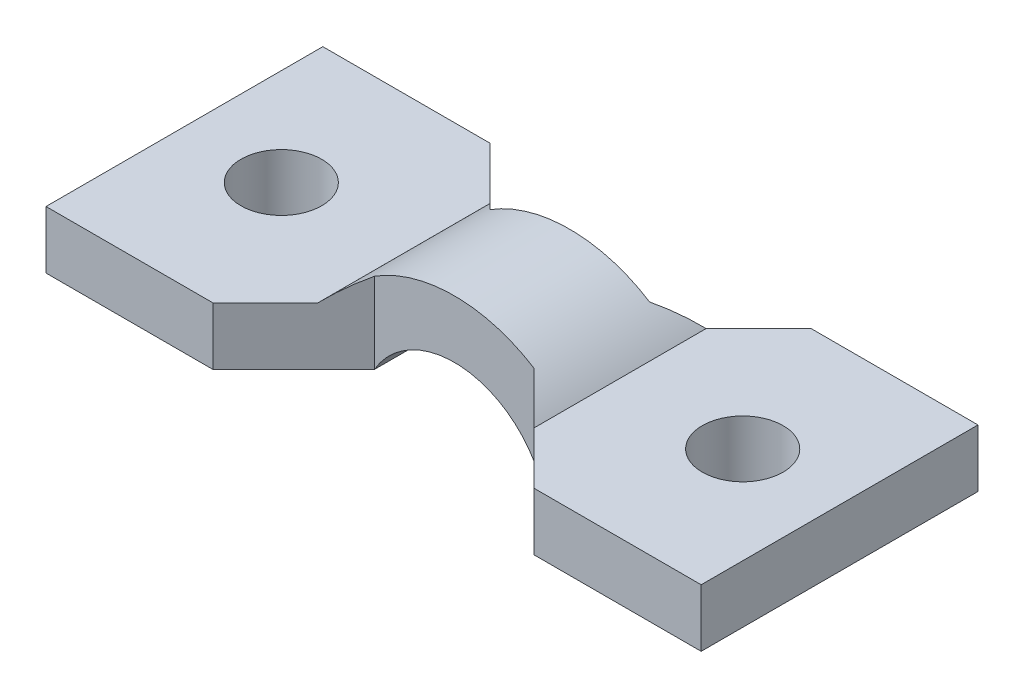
ISO-10303-21;
HEADER;
FILE_DESCRIPTION(('STEP AP214'),'2;1');
FILE_NAME('part.step','',(''),(''),'','','');
FILE_SCHEMA(('AUTOMOTIVE_DESIGN { 1 0 10303 214 1 1 1 1 }'));
ENDSEC;
DATA;
#1=APPLICATION_CONTEXT('core data for automotive mechanical design processes');
#2=APPLICATION_PROTOCOL_DEFINITION('international standard','automotive_design',2000,#1);
#3=PRODUCT_CONTEXT('',#1,'mechanical');
#4=PRODUCT('Part','Part','',(#3));
#5=PRODUCT_RELATED_PRODUCT_CATEGORY('part','',(#4));
#6=PRODUCT_DEFINITION_FORMATION('','',#4);
#7=PRODUCT_DEFINITION_CONTEXT('part definition',#1,'design');
#8=PRODUCT_DEFINITION('design','',#6,#7);
#9=PRODUCT_DEFINITION_SHAPE('','',#8);
#10=(LENGTH_UNIT() NAMED_UNIT(*) SI_UNIT(.MILLI.,.METRE.));
#11=(NAMED_UNIT(*) PLANE_ANGLE_UNIT() SI_UNIT($,.RADIAN.));
#12=(NAMED_UNIT(*) SI_UNIT($,.STERADIAN.) SOLID_ANGLE_UNIT());
#13=UNCERTAINTY_MEASURE_WITH_UNIT(LENGTH_MEASURE(1.E-05),#10,'distance_accuracy_value','');
#14=(GEOMETRIC_REPRESENTATION_CONTEXT(3) GLOBAL_UNCERTAINTY_ASSIGNED_CONTEXT((#13)) GLOBAL_UNIT_ASSIGNED_CONTEXT((#10,
#11,#12)) REPRESENTATION_CONTEXT('',''));
#15=CARTESIAN_POINT('',(0.,0.,0.));
#16=DIRECTION('',(0.,0.,1.));
#17=DIRECTION('',(1.,0.,0.));
#18=AXIS2_PLACEMENT_3D('',#15,#16,#17);
#19=CARTESIAN_POINT('',(0.,0.,12.));
#20=DIRECTION('',(0.,0.,-1.));
#21=DIRECTION('',(-1.,0.,0.));
#22=AXIS2_PLACEMENT_3D('',#19,#20,#21);
#23=CYLINDRICAL_SURFACE('',#22,6.5);
#24=CARTESIAN_POINT('',(0.,0.,3.5));
#25=DIRECTION('',(0.,0.,-1.));
#26=DIRECTION('',(-1.,0.,0.));
#27=AXIS2_PLACEMENT_3D('',#24,#25,#26);
#28=CIRCLE('',#27,6.5);
#29=CARTESIAN_POINT('',(-3.46410161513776,5.5,3.5));
#30=VERTEX_POINT('',#29);
#31=CARTESIAN_POINT('',(3.46410161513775,5.5,3.5));
#32=VERTEX_POINT('',#31);
#33=EDGE_CURVE('E298',#30,#32,#28,.T.);
#34=ORIENTED_EDGE('',*,*,#33,.F.);
#35=CARTESIAN_POINT('',(0.,0.,6.96410161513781));
#36=DIRECTION('',(-0.707106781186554,0.,0.707106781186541));
#37=DIRECTION('',(-0.707106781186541,0.,-0.707106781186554));
#38=AXIS2_PLACEMENT_3D('',#35,#36,#37);
#39=ELLIPSE('',#38,9.1923881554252,6.5);
#40=CARTESIAN_POINT('',(-4.69041575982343,4.5,2.2736858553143));
#41=VERTEX_POINT('',#40);
#42=EDGE_CURVE('E277',#30,#41,#39,.T.);
#43=ORIENTED_EDGE('',*,*,#42,.T.);
#44=DIRECTION('',(0.,0.,-1.));
#45=VECTOR('',#44,1.);
#46=CARTESIAN_POINT('',(-4.69041575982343,4.5,12.));
#47=LINE('',#46,#45);
#48=CARTESIAN_POINT('',(-4.69041575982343,4.5,9.72631414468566));
#49=VERTEX_POINT('',#48);
#50=EDGE_CURVE('E162',#49,#41,#47,.T.);
#51=ORIENTED_EDGE('',*,*,#50,.F.);
#52=CARTESIAN_POINT('',(0.,0.,5.03589838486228));
#53=DIRECTION('',(0.707106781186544,0.,0.707106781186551));
#54=DIRECTION('',(0.707106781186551,0.,-0.707106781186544));
#55=AXIS2_PLACEMENT_3D('',#52,#53,#54);
#56=ELLIPSE('',#55,9.19238815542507,6.5);
#57=CARTESIAN_POINT('',(-3.46410161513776,5.5,8.5));
#58=VERTEX_POINT('',#57);
#59=EDGE_CURVE('E292',#58,#49,#56,.T.);
#60=ORIENTED_EDGE('',*,*,#59,.F.);
#61=CARTESIAN_POINT('',(0.,0.,8.5));
#62=DIRECTION('',(0.,0.,-1.));
#63=DIRECTION('',(-1.,0.,0.));
#64=AXIS2_PLACEMENT_3D('',#61,#62,#63);
#65=CIRCLE('',#64,6.5);
#66=CARTESIAN_POINT('',(3.46410161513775,5.5,8.5));
#67=VERTEX_POINT('',#66);
#68=EDGE_CURVE('E295',#58,#67,#65,.T.);
#69=ORIENTED_EDGE('',*,*,#68,.T.);
#70=CARTESIAN_POINT('',(0.,0.,5.03589838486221));
#71=DIRECTION('',(0.707106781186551,0.,-0.707106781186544));
#72=DIRECTION('',(-0.707106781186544,0.,-0.707106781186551));
#73=AXIS2_PLACEMENT_3D('',#70,#71,#72);
#74=ELLIPSE('',#73,9.19238815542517,6.5);
#75=CARTESIAN_POINT('',(4.69041575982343,4.5,9.72631414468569));
#76=VERTEX_POINT('',#75);
#77=EDGE_CURVE('E285',#67,#76,#74,.T.);
#78=ORIENTED_EDGE('',*,*,#77,.T.);
#79=DIRECTION('',(0.,0.,-1.));
#80=VECTOR('',#79,1.);
#81=CARTESIAN_POINT('',(4.69041575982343,4.5,12.));
#82=LINE('',#81,#80);
#83=CARTESIAN_POINT('',(4.69041575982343,4.5,2.27368585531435));
#84=VERTEX_POINT('',#83);
#85=EDGE_CURVE('E194',#76,#84,#82,.T.);
#86=ORIENTED_EDGE('',*,*,#85,.T.);
#87=CARTESIAN_POINT('',(0.,0.,6.96410161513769));
#88=DIRECTION('',(-0.707106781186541,0.,-0.707106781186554));
#89=DIRECTION('',(0.707106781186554,0.,-0.707106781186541));
#90=AXIS2_PLACEMENT_3D('',#87,#88,#89);
#91=ELLIPSE('',#90,9.19238815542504,6.5);
#92=EDGE_CURVE('E270',#32,#84,#91,.T.);
#93=ORIENTED_EDGE('',*,*,#92,.F.);
#94=EDGE_LOOP('',(#34,#43,#51,#60,#69,#78,#86,#93));
#95=FACE_BOUND('',#94,.T.);
#96=ADVANCED_FACE('F51',(#95),#23,.T.);
#97=CARTESIAN_POINT('',(-4.69041575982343,4.5,12.));
#98=DIRECTION('',(0.,-1.,0.));
#99=DIRECTION('',(0.,0.,-1.));
#100=AXIS2_PLACEMENT_3D('',#97,#98,#99);
#101=PLANE('',#100);
#102=CARTESIAN_POINT('',(-10.,4.5,6.));
#103=DIRECTION('',(0.,1.,0.));
#104=DIRECTION('',(0.,0.,1.));
#105=AXIS2_PLACEMENT_3D('',#102,#103,#104);
#106=CIRCLE('',#105,1.75);
#107=CARTESIAN_POINT('',(-10.,4.5,7.75));
#108=VERTEX_POINT('',#107);
#109=EDGE_CURVE('E307',#108,#108,#106,.T.);
#110=ORIENTED_EDGE('',*,*,#109,.F.);
#111=EDGE_LOOP('',(#110));
#112=FACE_BOUND('',#111,.T.);
#113=ORIENTED_EDGE('',*,*,#50,.T.);
#114=DIRECTION('',(-0.707106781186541,0.,-0.707106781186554));
#115=VECTOR('',#114,1.);
#116=CARTESIAN_POINT('',(0.172741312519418,4.5,7.13684292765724));
#117=LINE('',#116,#115);
#118=CARTESIAN_POINT('',(-6.96410161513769,4.5,0.));
#119=VERTEX_POINT('',#118);
#120=EDGE_CURVE('E273',#41,#119,#117,.T.);
#121=ORIENTED_EDGE('',*,*,#120,.T.);
#122=DIRECTION('',(-1.,0.,0.));
#123=VECTOR('',#122,1.);
#124=CARTESIAN_POINT('',(-4.69041575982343,4.5,0.));
#125=LINE('',#124,#123);
#126=CARTESIAN_POINT('',(-14.2,4.5,0.));
#127=VERTEX_POINT('',#126);
#128=EDGE_CURVE('E306',#119,#127,#125,.T.);
#129=ORIENTED_EDGE('',*,*,#128,.T.);
#130=DIRECTION('',(0.,0.,-1.));
#131=VECTOR('',#130,1.);
#132=CARTESIAN_POINT('',(-14.2,4.5,12.));
#133=LINE('',#132,#131);
#134=CARTESIAN_POINT('',(-14.2,4.5,12.));
#135=VERTEX_POINT('',#134);
#136=EDGE_CURVE('E216',#135,#127,#133,.T.);
#137=ORIENTED_EDGE('',*,*,#136,.F.);
#138=DIRECTION('',(-1.,0.,0.));
#139=VECTOR('',#138,1.);
#140=CARTESIAN_POINT('',(-4.69041575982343,4.5,12.));
#141=LINE('',#140,#139);
#142=CARTESIAN_POINT('',(-6.96410161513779,4.5,12.));
#143=VERTEX_POINT('',#142);
#144=EDGE_CURVE('E193',#143,#135,#141,.T.);
#145=ORIENTED_EDGE('',*,*,#144,.F.);
#146=DIRECTION('',(-0.707106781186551,0.,0.707106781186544));
#147=VECTOR('',#146,1.);
#148=CARTESIAN_POINT('',(-5.8272586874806,4.5,10.8631570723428));
#149=LINE('',#148,#147);
#150=EDGE_CURVE('E289',#49,#143,#149,.T.);
#151=ORIENTED_EDGE('',*,*,#150,.F.);
#152=EDGE_LOOP('',(#113,#121,#129,#137,#145,#151));
#153=FACE_BOUND('',#152,.T.);
#154=ADVANCED_FACE('F348',(#112,#153),#101,.F.);
#155=CARTESIAN_POINT('',(-3.46410161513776,2.,12.));
#156=DIRECTION('',(0.,1.,0.));
#157=DIRECTION('',(-1.,0.,0.));
#158=AXIS2_PLACEMENT_3D('',#155,#156,#157);
#159=PLANE('',#158);
#160=CARTESIAN_POINT('',(-10.,2.,6.));
#161=DIRECTION('',(0.,1.,0.));
#162=DIRECTION('',(0.,0.,1.));
#163=AXIS2_PLACEMENT_3D('',#160,#161,#162);
#164=CIRCLE('',#163,1.75);
#165=CARTESIAN_POINT('',(-10.,2.,7.75));
#166=VERTEX_POINT('',#165);
#167=EDGE_CURVE('E302',#166,#166,#164,.T.);
#168=ORIENTED_EDGE('',*,*,#167,.T.);
#169=EDGE_LOOP('',(#168));
#170=FACE_BOUND('',#169,.T.);
#171=DIRECTION('',(1.,0.,0.));
#172=VECTOR('',#171,1.);
#173=CARTESIAN_POINT('',(-3.46410161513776,2.,0.));
#174=LINE('',#173,#172);
#175=CARTESIAN_POINT('',(-14.2,2.,0.));
#176=VERTEX_POINT('',#175);
#177=CARTESIAN_POINT('',(-6.96410161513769,2.,0.));
#178=VERTEX_POINT('',#177);
#179=EDGE_CURVE('E180',#176,#178,#174,.T.);
#180=ORIENTED_EDGE('',*,*,#179,.T.);
#181=DIRECTION('',(-0.707106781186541,0.,-0.707106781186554));
#182=VECTOR('',#181,1.);
#183=CARTESIAN_POINT('',(-3.48205080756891,2.,3.48205080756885));
#184=LINE('',#183,#182);
#185=CARTESIAN_POINT('',(-3.46410161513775,2.,3.5));
#186=VERTEX_POINT('',#185);
#187=EDGE_CURVE('E173',#186,#178,#184,.T.);
#188=ORIENTED_EDGE('',*,*,#187,.F.);
#189=DIRECTION('',(0.,0.,-1.));
#190=VECTOR('',#189,1.);
#191=CARTESIAN_POINT('',(-3.46410161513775,2.,12.));
#192=LINE('',#191,#190);
#193=CARTESIAN_POINT('',(-3.46410161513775,2.,8.5));
#194=VERTEX_POINT('',#193);
#195=EDGE_CURVE('E208',#194,#186,#192,.T.);
#196=ORIENTED_EDGE('',*,*,#195,.F.);
#197=DIRECTION('',(-0.707106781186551,0.,0.707106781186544));
#198=VECTOR('',#197,1.);
#199=CARTESIAN_POINT('',(2.51794919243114,2.,2.51794919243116));
#200=LINE('',#199,#198);
#201=CARTESIAN_POINT('',(-6.96410161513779,2.,12.));
#202=VERTEX_POINT('',#201);
#203=EDGE_CURVE('E245',#194,#202,#200,.T.);
#204=ORIENTED_EDGE('',*,*,#203,.T.);
#205=DIRECTION('',(1.,0.,0.));
#206=VECTOR('',#205,1.);
#207=CARTESIAN_POINT('',(-3.46410161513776,2.,12.));
#208=LINE('',#207,#206);
#209=CARTESIAN_POINT('',(-14.2,2.,12.));
#210=VERTEX_POINT('',#209);
#211=EDGE_CURVE('E323',#210,#202,#208,.T.);
#212=ORIENTED_EDGE('',*,*,#211,.F.);
#213=DIRECTION('',(0.,0.,-1.));
#214=VECTOR('',#213,1.);
#215=CARTESIAN_POINT('',(-14.2,2.,12.));
#216=LINE('',#215,#214);
#217=EDGE_CURVE('E212',#210,#176,#216,.T.);
#218=ORIENTED_EDGE('',*,*,#217,.T.);
#219=EDGE_LOOP('',(#180,#188,#196,#204,#212,#218));
#220=FACE_BOUND('',#219,.T.);
#221=ADVANCED_FACE('F242',(#170,#220),#159,.F.);
#222=CARTESIAN_POINT('',(0.,0.,12.));
#223=DIRECTION('',(0.,0.,-1.));
#224=DIRECTION('',(-1.,0.,0.));
#225=AXIS2_PLACEMENT_3D('',#222,#223,#224);
#226=CYLINDRICAL_SURFACE('',#225,4.);
#227=CARTESIAN_POINT('',(0.,0.,3.5));
#228=DIRECTION('',(0.,0.,-1.));
#229=DIRECTION('',(-1.,0.,0.));
#230=AXIS2_PLACEMENT_3D('',#227,#228,#229);
#231=CIRCLE('',#230,4.);
#232=CARTESIAN_POINT('',(3.46410161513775,2.,3.5));
#233=VERTEX_POINT('',#232);
#234=EDGE_CURVE('E11',#233,#186,#231,.F.);
#235=ORIENTED_EDGE('',*,*,#234,.F.);
#236=DIRECTION('',(0.,0.,-1.));
#237=VECTOR('',#236,1.);
#238=CARTESIAN_POINT('',(3.46410161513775,2.,12.));
#239=LINE('',#238,#237);
#240=CARTESIAN_POINT('',(3.46410161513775,2.,8.5));
#241=VERTEX_POINT('',#240);
#242=EDGE_CURVE('E171',#241,#233,#239,.T.);
#243=ORIENTED_EDGE('',*,*,#242,.F.);
#244=CARTESIAN_POINT('',(0.,0.,8.5));
#245=DIRECTION('',(0.,0.,-1.));
#246=DIRECTION('',(-1.,0.,0.));
#247=AXIS2_PLACEMENT_3D('',#244,#245,#246);
#248=CIRCLE('',#247,4.);
#249=EDGE_CURVE('E59',#241,#194,#248,.F.);
#250=ORIENTED_EDGE('',*,*,#249,.T.);
#251=ORIENTED_EDGE('',*,*,#195,.T.);
#252=EDGE_LOOP('',(#235,#243,#250,#251));
#253=FACE_BOUND('',#252,.T.);
#254=ADVANCED_FACE('F236',(#253),#226,.F.);
#255=CARTESIAN_POINT('',(3.46410161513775,2.,12.));
#256=DIRECTION('',(0.,1.,0.));
#257=DIRECTION('',(-1.,0.,0.));
#258=AXIS2_PLACEMENT_3D('',#255,#256,#257);
#259=PLANE('',#258);
#260=CARTESIAN_POINT('',(10.,2.,6.));
#261=DIRECTION('',(0.,1.,0.));
#262=DIRECTION('',(0.,0.,1.));
#263=AXIS2_PLACEMENT_3D('',#260,#261,#262);
#264=CIRCLE('',#263,1.75);
#265=CARTESIAN_POINT('',(10.,2.,7.75));
#266=VERTEX_POINT('',#265);
#267=EDGE_CURVE('E301',#266,#266,#264,.T.);
#268=ORIENTED_EDGE('',*,*,#267,.T.);
#269=EDGE_LOOP('',(#268));
#270=FACE_BOUND('',#269,.T.);
#271=DIRECTION('',(0.707106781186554,0.,-0.707106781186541));
#272=VECTOR('',#271,1.);
#273=CARTESIAN_POINT('',(3.48205080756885,2.,3.48205080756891));
#274=LINE('',#273,#272);
#275=CARTESIAN_POINT('',(6.96410161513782,2.,0.));
#276=VERTEX_POINT('',#275);
#277=EDGE_CURVE('E154',#233,#276,#274,.T.);
#278=ORIENTED_EDGE('',*,*,#277,.T.);
#279=DIRECTION('',(1.,0.,0.));
#280=VECTOR('',#279,1.);
#281=CARTESIAN_POINT('',(3.46410161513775,2.,0.));
#282=LINE('',#281,#280);
#283=CARTESIAN_POINT('',(14.2,2.,0.));
#284=VERTEX_POINT('',#283);
#285=EDGE_CURVE('E168',#276,#284,#282,.T.);
#286=ORIENTED_EDGE('',*,*,#285,.T.);
#287=DIRECTION('',(0.,0.,-1.));
#288=VECTOR('',#287,1.);
#289=CARTESIAN_POINT('',(14.2,2.,12.));
#290=LINE('',#289,#288);
#291=CARTESIAN_POINT('',(14.2,2.,12.));
#292=VERTEX_POINT('',#291);
#293=EDGE_CURVE('E203',#292,#284,#290,.T.);
#294=ORIENTED_EDGE('',*,*,#293,.F.);
#295=DIRECTION('',(1.,0.,0.));
#296=VECTOR('',#295,1.);
#297=CARTESIAN_POINT('',(3.46410161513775,2.,12.));
#298=LINE('',#297,#296);
#299=CARTESIAN_POINT('',(6.96410161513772,2.,12.));
#300=VERTEX_POINT('',#299);
#301=EDGE_CURVE('E326',#300,#292,#298,.T.);
#302=ORIENTED_EDGE('',*,*,#301,.F.);
#303=DIRECTION('',(0.707106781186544,0.,0.707106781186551));
#304=VECTOR('',#303,1.);
#305=CARTESIAN_POINT('',(-2.51794919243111,2.,2.51794919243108));
#306=LINE('',#305,#304);
#307=EDGE_CURVE('E66',#241,#300,#306,.T.);
#308=ORIENTED_EDGE('',*,*,#307,.F.);
#309=ORIENTED_EDGE('',*,*,#242,.T.);
#310=EDGE_LOOP('',(#278,#286,#294,#302,#308,#309));
#311=FACE_BOUND('',#310,.T.);
#312=ADVANCED_FACE('F166',(#270,#311),#259,.F.);
#313=CARTESIAN_POINT('',(4.69041575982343,4.5,12.));
#314=DIRECTION('',(0.,-1.,0.));
#315=DIRECTION('',(0.,0.,-1.));
#316=AXIS2_PLACEMENT_3D('',#313,#314,#315);
#317=PLANE('',#316);
#318=CARTESIAN_POINT('',(10.,4.5,6.));
#319=DIRECTION('',(0.,1.,0.));
#320=DIRECTION('',(0.,0.,1.));
#321=AXIS2_PLACEMENT_3D('',#318,#319,#320);
#322=CIRCLE('',#321,1.75);
#323=CARTESIAN_POINT('',(10.,4.5,7.75));
#324=VERTEX_POINT('',#323);
#325=EDGE_CURVE('E311',#324,#324,#322,.T.);
#326=ORIENTED_EDGE('',*,*,#325,.F.);
#327=EDGE_LOOP('',(#326));
#328=FACE_BOUND('',#327,.T.);
#329=DIRECTION('',(0.707106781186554,0.,-0.707106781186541));
#330=VECTOR('',#329,1.);
#331=CARTESIAN_POINT('',(-0.172741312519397,4.5,7.13684292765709));
#332=LINE('',#331,#330);
#333=CARTESIAN_POINT('',(6.96410161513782,4.5,0.));
#334=VERTEX_POINT('',#333);
#335=EDGE_CURVE('E74',#84,#334,#332,.T.);
#336=ORIENTED_EDGE('',*,*,#335,.F.);
#337=ORIENTED_EDGE('',*,*,#85,.F.);
#338=DIRECTION('',(0.707106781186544,0.,0.707106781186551));
#339=VECTOR('',#338,1.);
#340=CARTESIAN_POINT('',(5.82725868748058,4.5,10.8631570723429));
#341=LINE('',#340,#339);
#342=CARTESIAN_POINT('',(6.96410161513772,4.5,12.));
#343=VERTEX_POINT('',#342);
#344=EDGE_CURVE('E281',#76,#343,#341,.T.);
#345=ORIENTED_EDGE('',*,*,#344,.T.);
#346=DIRECTION('',(-1.,0.,0.));
#347=VECTOR('',#346,1.);
#348=CARTESIAN_POINT('',(4.69041575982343,4.5,12.));
#349=LINE('',#348,#347);
#350=CARTESIAN_POINT('',(14.2,4.5,12.));
#351=VERTEX_POINT('',#350);
#352=EDGE_CURVE('E199',#351,#343,#349,.T.);
#353=ORIENTED_EDGE('',*,*,#352,.F.);
#354=DIRECTION('',(0.,0.,-1.));
#355=VECTOR('',#354,1.);
#356=CARTESIAN_POINT('',(14.2,4.5,12.));
#357=LINE('',#356,#355);
#358=CARTESIAN_POINT('',(14.2,4.5,0.));
#359=VERTEX_POINT('',#358);
#360=EDGE_CURVE('E198',#351,#359,#357,.T.);
#361=ORIENTED_EDGE('',*,*,#360,.T.);
#362=DIRECTION('',(-1.,0.,0.));
#363=VECTOR('',#362,1.);
#364=CARTESIAN_POINT('',(4.69041575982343,4.5,0.));
#365=LINE('',#364,#363);
#366=EDGE_CURVE('E184',#359,#334,#365,.T.);
#367=ORIENTED_EDGE('',*,*,#366,.T.);
#368=EDGE_LOOP('',(#336,#337,#345,#353,#361,#367));
#369=FACE_BOUND('',#368,.T.);
#370=ADVANCED_FACE('F362',(#328,#369),#317,.F.);
#371=CARTESIAN_POINT('',(0.,0.,12.));
#372=DIRECTION('',(0.,0.,1.));
#373=DIRECTION('',(1.,0.,0.));
#374=AXIS2_PLACEMENT_3D('',#371,#372,#373);
#375=PLANE('',#374);
#376=ORIENTED_EDGE('',*,*,#211,.T.);
#377=DIRECTION('',(0.,1.,0.));
#378=VECTOR('',#377,1.);
#379=CARTESIAN_POINT('',(-6.96410161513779,0.,12.));
#380=LINE('',#379,#378);
#381=EDGE_CURVE('E229',#202,#143,#380,.T.);
#382=ORIENTED_EDGE('',*,*,#381,.T.);
#383=ORIENTED_EDGE('',*,*,#144,.T.);
#384=DIRECTION('',(0.,-1.,0.));
#385=VECTOR('',#384,1.);
#386=CARTESIAN_POINT('',(-14.2,4.5,12.));
#387=LINE('',#386,#385);
#388=EDGE_CURVE('E320',#135,#210,#387,.T.);
#389=ORIENTED_EDGE('',*,*,#388,.T.);
#390=EDGE_LOOP('',(#376,#382,#383,#389));
#391=FACE_BOUND('',#390,.T.);
#392=ADVANCED_FACE('F377',(#391),#375,.T.);
#393=CARTESIAN_POINT('',(0.,0.,0.));
#394=DIRECTION('',(0.,0.,1.));
#395=DIRECTION('',(1.,0.,0.));
#396=AXIS2_PLACEMENT_3D('',#393,#394,#395);
#397=PLANE('',#396);
#398=DIRECTION('',(0.,-1.,0.));
#399=VECTOR('',#398,1.);
#400=CARTESIAN_POINT('',(6.96410161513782,0.,0.));
#401=LINE('',#400,#399);
#402=EDGE_CURVE('E150',#334,#276,#401,.T.);
#403=ORIENTED_EDGE('',*,*,#402,.F.);
#404=ORIENTED_EDGE('',*,*,#366,.F.);
#405=DIRECTION('',(0.,1.,0.));
#406=VECTOR('',#405,1.);
#407=CARTESIAN_POINT('',(14.2,4.5,0.));
#408=LINE('',#407,#406);
#409=EDGE_CURVE('E178',#284,#359,#408,.T.);
#410=ORIENTED_EDGE('',*,*,#409,.F.);
#411=ORIENTED_EDGE('',*,*,#285,.F.);
#412=EDGE_LOOP('',(#403,#404,#410,#411));
#413=FACE_BOUND('',#412,.T.);
#414=ADVANCED_FACE('F177',(#413),#397,.F.);
#415=CARTESIAN_POINT('',(-14.2,4.5,12.));
#416=DIRECTION('',(1.,0.,0.));
#417=DIRECTION('',(0.,0.,-1.));
#418=AXIS2_PLACEMENT_3D('',#415,#416,#417);
#419=PLANE('',#418);
#420=DIRECTION('',(0.,-1.,0.));
#421=VECTOR('',#420,1.);
#422=CARTESIAN_POINT('',(-14.2,4.5,0.));
#423=LINE('',#422,#421);
#424=EDGE_CURVE('E187',#127,#176,#423,.T.);
#425=ORIENTED_EDGE('',*,*,#424,.T.);
#426=ORIENTED_EDGE('',*,*,#217,.F.);
#427=ORIENTED_EDGE('',*,*,#388,.F.);
#428=ORIENTED_EDGE('',*,*,#136,.T.);
#429=EDGE_LOOP('',(#425,#426,#427,#428));
#430=FACE_BOUND('',#429,.T.);
#431=ADVANCED_FACE('F340',(#430),#419,.F.);
#432=CARTESIAN_POINT('',(14.2,4.5,12.));
#433=DIRECTION('',(-1.,0.,0.));
#434=DIRECTION('',(0.,0.,1.));
#435=AXIS2_PLACEMENT_3D('',#432,#433,#434);
#436=PLANE('',#435);
#437=ORIENTED_EDGE('',*,*,#409,.T.);
#438=ORIENTED_EDGE('',*,*,#360,.F.);
#439=DIRECTION('',(0.,1.,0.));
#440=VECTOR('',#439,1.);
#441=CARTESIAN_POINT('',(14.2,4.5,12.));
#442=LINE('',#441,#440);
#443=EDGE_CURVE('E329',#292,#351,#442,.T.);
#444=ORIENTED_EDGE('',*,*,#443,.F.);
#445=ORIENTED_EDGE('',*,*,#293,.T.);
#446=EDGE_LOOP('',(#437,#438,#444,#445));
#447=FACE_BOUND('',#446,.T.);
#448=ADVANCED_FACE('F367',(#447),#436,.F.);
#449=DIRECTION('',(0.,1.,0.));
#450=VECTOR('',#449,1.);
#451=CARTESIAN_POINT('',(6.96410161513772,0.,12.));
#452=LINE('',#451,#450);
#453=EDGE_CURVE('E226',#300,#343,#452,.T.);
#454=ORIENTED_EDGE('',*,*,#453,.F.);
#455=ORIENTED_EDGE('',*,*,#301,.T.);
#456=ORIENTED_EDGE('',*,*,#443,.T.);
#457=ORIENTED_EDGE('',*,*,#352,.T.);
#458=EDGE_LOOP('',(#454,#455,#456,#457));
#459=FACE_BOUND('',#458,.T.);
#460=ADVANCED_FACE('F370',(#459),#375,.T.);
#461=ORIENTED_EDGE('',*,*,#128,.F.);
#462=DIRECTION('',(0.,-1.,0.));
#463=VECTOR('',#462,1.);
#464=CARTESIAN_POINT('',(-6.96410161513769,0.,0.));
#465=LINE('',#464,#463);
#466=EDGE_CURVE('E161',#119,#178,#465,.T.);
#467=ORIENTED_EDGE('',*,*,#466,.T.);
#468=ORIENTED_EDGE('',*,*,#179,.F.);
#469=ORIENTED_EDGE('',*,*,#424,.F.);
#470=EDGE_LOOP('',(#461,#467,#468,#469));
#471=FACE_BOUND('',#470,.T.);
#472=ADVANCED_FACE('F345',(#471),#397,.F.);
#473=CARTESIAN_POINT('',(10.,2.,6.));
#474=DIRECTION('',(0.,1.,0.));
#475=DIRECTION('',(0.,0.,1.));
#476=AXIS2_PLACEMENT_3D('',#473,#474,#475);
#477=CYLINDRICAL_SURFACE('',#476,1.75);
#478=ORIENTED_EDGE('',*,*,#267,.F.);
#479=EDGE_LOOP('',(#478));
#480=FACE_BOUND('',#479,.T.);
#481=ORIENTED_EDGE('',*,*,#325,.T.);
#482=EDGE_LOOP('',(#481));
#483=FACE_BOUND('',#482,.T.);
#484=ADVANCED_FACE('F410',(#480,#483),#477,.F.);
#485=CARTESIAN_POINT('',(-10.,2.,6.));
#486=DIRECTION('',(0.,1.,0.));
#487=DIRECTION('',(0.,0.,1.));
#488=AXIS2_PLACEMENT_3D('',#485,#486,#487);
#489=CYLINDRICAL_SURFACE('',#488,1.75);
#490=ORIENTED_EDGE('',*,*,#167,.F.);
#491=EDGE_LOOP('',(#490));
#492=FACE_BOUND('',#491,.T.);
#493=ORIENTED_EDGE('',*,*,#109,.T.);
#494=EDGE_LOOP('',(#493));
#495=FACE_BOUND('',#494,.T.);
#496=ADVANCED_FACE('F414',(#492,#495),#489,.F.);
#497=CARTESIAN_POINT('',(0.,6.5,3.5));
#498=DIRECTION('',(0.,0.,-1.));
#499=DIRECTION('',(-1.,0.,0.));
#500=AXIS2_PLACEMENT_3D('',#497,#498,#499);
#501=PLANE('',#500);
#502=ORIENTED_EDGE('',*,*,#33,.T.);
#503=DIRECTION('',(0.,-1.,0.));
#504=VECTOR('',#503,1.);
#505=CARTESIAN_POINT('',(3.46410161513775,6.5,3.5));
#506=LINE('',#505,#504);
#507=EDGE_CURVE('E251',#32,#233,#506,.T.);
#508=ORIENTED_EDGE('',*,*,#507,.T.);
#509=ORIENTED_EDGE('',*,*,#234,.T.);
#510=DIRECTION('',(0.,-1.,0.));
#511=VECTOR('',#510,1.);
#512=CARTESIAN_POINT('',(-3.46410161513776,6.5,3.5));
#513=LINE('',#512,#511);
#514=EDGE_CURVE('E254',#30,#186,#513,.T.);
#515=ORIENTED_EDGE('',*,*,#514,.F.);
#516=EDGE_LOOP('',(#502,#508,#509,#515));
#517=FACE_BOUND('',#516,.T.);
#518=ADVANCED_FACE('F358',(#517),#501,.T.);
#519=CARTESIAN_POINT('',(-3.48205080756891,6.5,3.48205080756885));
#520=DIRECTION('',(-0.707106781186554,0.,0.707106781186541));
#521=DIRECTION('',(0.707106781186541,0.,0.707106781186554));
#522=AXIS2_PLACEMENT_3D('',#519,#520,#521);
#523=PLANE('',#522);
#524=ORIENTED_EDGE('',*,*,#514,.T.);
#525=ORIENTED_EDGE('',*,*,#187,.T.);
#526=ORIENTED_EDGE('',*,*,#466,.F.);
#527=ORIENTED_EDGE('',*,*,#120,.F.);
#528=ORIENTED_EDGE('',*,*,#42,.F.);
#529=EDGE_LOOP('',(#524,#525,#526,#527,#528));
#530=FACE_BOUND('',#529,.T.);
#531=ADVANCED_FACE('F346',(#530),#523,.F.);
#532=CARTESIAN_POINT('',(3.48205080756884,6.5,3.48205080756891));
#533=DIRECTION('',(-0.707106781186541,0.,-0.707106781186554));
#534=DIRECTION('',(-0.707106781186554,0.,0.707106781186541));
#535=AXIS2_PLACEMENT_3D('',#532,#533,#534);
#536=PLANE('',#535);
#537=ORIENTED_EDGE('',*,*,#92,.T.);
#538=ORIENTED_EDGE('',*,*,#335,.T.);
#539=ORIENTED_EDGE('',*,*,#402,.T.);
#540=ORIENTED_EDGE('',*,*,#277,.F.);
#541=ORIENTED_EDGE('',*,*,#507,.F.);
#542=EDGE_LOOP('',(#537,#538,#539,#540,#541));
#543=FACE_BOUND('',#542,.T.);
#544=ADVANCED_FACE('F152',(#543),#536,.T.);
#545=CARTESIAN_POINT('',(0.,6.5,8.5));
#546=DIRECTION('',(0.,0.,-1.));
#547=DIRECTION('',(-1.,0.,0.));
#548=AXIS2_PLACEMENT_3D('',#545,#546,#547);
#549=PLANE('',#548);
#550=DIRECTION('',(0.,-1.,0.));
#551=VECTOR('',#550,1.);
#552=CARTESIAN_POINT('',(-3.46410161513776,6.5,8.5));
#553=LINE('',#552,#551);
#554=EDGE_CURVE('E263',#58,#194,#553,.T.);
#555=ORIENTED_EDGE('',*,*,#554,.T.);
#556=ORIENTED_EDGE('',*,*,#249,.F.);
#557=DIRECTION('',(0.,-1.,0.));
#558=VECTOR('',#557,1.);
#559=CARTESIAN_POINT('',(3.46410161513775,6.5,8.5));
#560=LINE('',#559,#558);
#561=EDGE_CURVE('E174',#67,#241,#560,.T.);
#562=ORIENTED_EDGE('',*,*,#561,.F.);
#563=ORIENTED_EDGE('',*,*,#68,.F.);
#564=EDGE_LOOP('',(#555,#556,#562,#563));
#565=FACE_BOUND('',#564,.T.);
#566=ADVANCED_FACE('F372',(#565),#549,.F.);
#567=CARTESIAN_POINT('',(2.51794919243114,6.5,2.51794919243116));
#568=DIRECTION('',(0.707106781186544,0.,0.707106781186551));
#569=DIRECTION('',(0.707106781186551,0.,-0.707106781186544));
#570=AXIS2_PLACEMENT_3D('',#567,#568,#569);
#571=PLANE('',#570);
#572=ORIENTED_EDGE('',*,*,#59,.T.);
#573=ORIENTED_EDGE('',*,*,#150,.T.);
#574=ORIENTED_EDGE('',*,*,#381,.F.);
#575=ORIENTED_EDGE('',*,*,#203,.F.);
#576=ORIENTED_EDGE('',*,*,#554,.F.);
#577=EDGE_LOOP('',(#572,#573,#574,#575,#576));
#578=FACE_BOUND('',#577,.T.);
#579=ADVANCED_FACE('F375',(#578),#571,.T.);
#580=CARTESIAN_POINT('',(-2.51794919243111,6.5,2.51794919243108));
#581=DIRECTION('',(0.707106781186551,0.,-0.707106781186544));
#582=DIRECTION('',(-0.707106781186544,0.,-0.707106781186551));
#583=AXIS2_PLACEMENT_3D('',#580,#581,#582);
#584=PLANE('',#583);
#585=ORIENTED_EDGE('',*,*,#561,.T.);
#586=ORIENTED_EDGE('',*,*,#307,.T.);
#587=ORIENTED_EDGE('',*,*,#453,.T.);
#588=ORIENTED_EDGE('',*,*,#344,.F.);
#589=ORIENTED_EDGE('',*,*,#77,.F.);
#590=EDGE_LOOP('',(#585,#586,#587,#588,#589));
#591=FACE_BOUND('',#590,.T.);
#592=ADVANCED_FACE('F371',(#591),#584,.F.);
#593=CLOSED_SHELL('',(#96,#154,#221,#254,#312,#370,#392,#414,#431,#448,#460,#472,#484,#496,#518,
#531,#544,#566,#579,#592));
#594=MANIFOLD_SOLID_BREP('B2',#593);
#595=ADVANCED_BREP_SHAPE_REPRESENTATION('',(#18,#594),#14);
#596=SHAPE_DEFINITION_REPRESENTATION(#9,#595);
ENDSEC;
END-ISO-10303-21;
